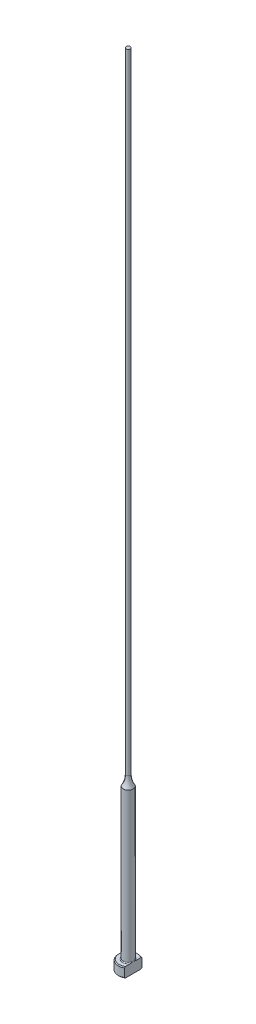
ISO-10303-21;
HEADER;
FILE_DESCRIPTION(('STEP AP214'),'2;1');
FILE_NAME('part.step','',(''),(''),'','','');
FILE_SCHEMA(('AUTOMOTIVE_DESIGN { 1 0 10303 214 1 1 1 1 }'));
ENDSEC;
DATA;
#1=APPLICATION_CONTEXT('core data for automotive mechanical design processes');
#2=APPLICATION_PROTOCOL_DEFINITION('international standard','automotive_design',2000,#1);
#3=PRODUCT_CONTEXT('',#1,'mechanical');
#4=PRODUCT('Part','Part','',(#3));
#5=PRODUCT_RELATED_PRODUCT_CATEGORY('part','',(#4));
#6=PRODUCT_DEFINITION_FORMATION('','',#4);
#7=PRODUCT_DEFINITION_CONTEXT('part definition',#1,'design');
#8=PRODUCT_DEFINITION('design','',#6,#7);
#9=PRODUCT_DEFINITION_SHAPE('','',#8);
#10=(LENGTH_UNIT() NAMED_UNIT(*) SI_UNIT(.MILLI.,.METRE.));
#11=(NAMED_UNIT(*) PLANE_ANGLE_UNIT() SI_UNIT($,.RADIAN.));
#12=(NAMED_UNIT(*) SI_UNIT($,.STERADIAN.) SOLID_ANGLE_UNIT());
#13=UNCERTAINTY_MEASURE_WITH_UNIT(LENGTH_MEASURE(1.E-05),#10,'distance_accuracy_value','');
#14=(GEOMETRIC_REPRESENTATION_CONTEXT(3) GLOBAL_UNCERTAINTY_ASSIGNED_CONTEXT((#13)) GLOBAL_UNIT_ASSIGNED_CONTEXT((#10,
#11,#12)) REPRESENTATION_CONTEXT('',''));
#15=CARTESIAN_POINT('',(0.,0.,0.));
#16=DIRECTION('',(0.,0.,1.));
#17=DIRECTION('',(1.,0.,0.));
#18=AXIS2_PLACEMENT_3D('',#15,#16,#17);
#19=CARTESIAN_POINT('',(-3.17499999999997,3.175,0.));
#20=DIRECTION('',(0.,1.,0.));
#21=DIRECTION('',(0.,0.,1.));
#22=AXIS2_PLACEMENT_3D('',#19,#20,#21);
#23=PLANE('',#22);
#24=CARTESIAN_POINT('',(0.,3.175,0.));
#25=DIRECTION('',(0.,1.,0.));
#26=DIRECTION('',(0.,0.,1.));
#27=AXIS2_PLACEMENT_3D('',#24,#25,#26);
#28=CIRCLE('',#27,2.92099999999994);
#29=CARTESIAN_POINT('',(1.58749999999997,3.175,-2.45195529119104));
#30=VERTEX_POINT('',#29);
#31=CARTESIAN_POINT('',(1.58749999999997,3.175,2.45195529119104));
#32=VERTEX_POINT('',#31);
#33=EDGE_CURVE('E105',#30,#32,#28,.T.);
#34=ORIENTED_EDGE('',*,*,#33,.T.);
#35=DIRECTION('',(0.,0.,1.));
#36=VECTOR('',#35,1.);
#37=CARTESIAN_POINT('',(1.58749999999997,3.17499999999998,2.74963065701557));
#38=LINE('',#37,#36);
#39=CARTESIAN_POINT('',(1.58749999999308,3.175,0.933255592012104));
#40=VERTEX_POINT('',#39);
#41=EDGE_CURVE('E126',#40,#32,#38,.T.);
#42=ORIENTED_EDGE('',*,*,#41,.F.);
#43=CARTESIAN_POINT('',(0.,3.175,0.));
#44=DIRECTION('',(0.,1.,0.));
#45=DIRECTION('',(0.,0.,1.));
#46=AXIS2_PLACEMENT_3D('',#43,#44,#45);
#47=CIRCLE('',#46,1.84149999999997);
#48=CARTESIAN_POINT('',(1.58749999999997,3.17500000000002,-0.933255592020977));
#49=VERTEX_POINT('',#48);
#50=EDGE_CURVE('E11',#40,#49,#47,.F.);
#51=ORIENTED_EDGE('',*,*,#50,.T.);
#52=EDGE_CURVE('E52',#30,#49,#38,.T.);
#53=ORIENTED_EDGE('',*,*,#52,.F.);
#54=EDGE_LOOP('',(#34,#42,#51,#53));
#55=FACE_BOUND('',#54,.T.);
#56=ADVANCED_FACE('F32',(#55),#23,.T.);
#57=CARTESIAN_POINT('',(0.,259.958771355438,0.));
#58=DIRECTION('',(0.,1.,0.));
#59=DIRECTION('',(0.,0.,1.));
#60=AXIS2_PLACEMENT_3D('',#57,#58,#59);
#61=CYLINDRICAL_SURFACE('',#60,3.17499999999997);
#62=CARTESIAN_POINT('',(0.,2.92100000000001,0.));
#63=DIRECTION('',(0.,1.,0.));
#64=DIRECTION('',(0.,0.,1.));
#65=AXIS2_PLACEMENT_3D('',#62,#63,#64);
#66=CIRCLE('',#65,3.17499999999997);
#67=CARTESIAN_POINT('',(1.58749999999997,2.92100000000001,2.74963065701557));
#68=VERTEX_POINT('',#67);
#69=CARTESIAN_POINT('',(1.58749999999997,2.92100000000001,-2.74963065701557));
#70=VERTEX_POINT('',#69);
#71=EDGE_CURVE('E98',#68,#70,#66,.F.);
#72=ORIENTED_EDGE('',*,*,#71,.T.);
#73=DIRECTION('',(0.,-1.,0.));
#74=VECTOR('',#73,1.);
#75=CARTESIAN_POINT('',(1.58749999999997,254.001,-2.74963065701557));
#76=LINE('',#75,#74);
#77=CARTESIAN_POINT('',(1.58749999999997,0.253999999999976,-2.74963065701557));
#78=VERTEX_POINT('',#77);
#79=EDGE_CURVE('E141',#70,#78,#76,.T.);
#80=ORIENTED_EDGE('',*,*,#79,.T.);
#81=CARTESIAN_POINT('',(0.,0.253999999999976,0.));
#82=DIRECTION('',(0.,-1.,0.));
#83=DIRECTION('',(0.,0.,-1.));
#84=AXIS2_PLACEMENT_3D('',#81,#82,#83);
#85=CIRCLE('',#84,3.17499999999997);
#86=CARTESIAN_POINT('',(1.58749999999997,0.253999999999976,2.74963065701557));
#87=VERTEX_POINT('',#86);
#88=EDGE_CURVE('E95',#78,#87,#85,.F.);
#89=ORIENTED_EDGE('',*,*,#88,.T.);
#90=DIRECTION('',(0.,-1.,0.));
#91=VECTOR('',#90,1.);
#92=CARTESIAN_POINT('',(1.58749999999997,254.001,2.74963065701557));
#93=LINE('',#92,#91);
#94=EDGE_CURVE('E88',#68,#87,#93,.T.);
#95=ORIENTED_EDGE('',*,*,#94,.F.);
#96=EDGE_LOOP('',(#72,#80,#89,#95));
#97=FACE_BOUND('',#96,.T.);
#98=ADVANCED_FACE('F191',(#97),#61,.T.);
#99=CARTESIAN_POINT('',(0.,0.,0.));
#100=DIRECTION('',(0.,-1.,0.));
#101=DIRECTION('',(0.,0.,-1.));
#102=AXIS2_PLACEMENT_3D('',#99,#100,#101);
#103=PLANE('',#102);
#104=CARTESIAN_POINT('',(0.,0.,0.));
#105=DIRECTION('',(0.,-1.,0.));
#106=DIRECTION('',(0.,0.,-1.));
#107=AXIS2_PLACEMENT_3D('',#104,#105,#106);
#108=CIRCLE('',#107,2.92100000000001);
#109=CARTESIAN_POINT('',(1.58749999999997,0.,2.45195529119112));
#110=VERTEX_POINT('',#109);
#111=CARTESIAN_POINT('',(1.58749999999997,0.,-2.45195529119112));
#112=VERTEX_POINT('',#111);
#113=EDGE_CURVE('E93',#110,#112,#108,.T.);
#114=ORIENTED_EDGE('',*,*,#113,.T.);
#115=DIRECTION('',(0.,0.,1.));
#116=VECTOR('',#115,1.);
#117=CARTESIAN_POINT('',(1.58749999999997,0.,2.74963065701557));
#118=LINE('',#117,#116);
#119=EDGE_CURVE('E78',#112,#110,#118,.T.);
#120=ORIENTED_EDGE('',*,*,#119,.T.);
#121=EDGE_LOOP('',(#114,#120));
#122=FACE_BOUND('',#121,.T.);
#123=ADVANCED_FACE('F97',(#122),#103,.T.);
#124=CARTESIAN_POINT('',(0.,3.17499999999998,0.));
#125=DIRECTION('',(0.,-1.,0.));
#126=DIRECTION('',(0.,0.,-1.));
#127=AXIS2_PLACEMENT_3D('',#124,#125,#126);
#128=CONICAL_SURFACE('',#127,2.92099999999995,0.785398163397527);
#129=ORIENTED_EDGE('',*,*,#71,.F.);
#130=CARTESIAN_POINT('',(1.58749999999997,-0.16162066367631,-6.0529050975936));
#131=CARTESIAN_POINT('',(1.58749999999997,-0.0288893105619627,-5.91567682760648));
#132=CARTESIAN_POINT('',(1.58749999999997,0.103699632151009,-5.7783103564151));
#133=CARTESIAN_POINT('',(1.58749999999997,0.368508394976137,-5.50321874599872));
#134=CARTESIAN_POINT('',(1.58749999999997,0.500728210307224,-5.36549360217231));
#135=CARTESIAN_POINT('',(1.58749999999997,0.764778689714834,-5.08953516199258));
#136=CARTESIAN_POINT('',(1.58749999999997,0.896609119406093,-4.9513016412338));
#137=CARTESIAN_POINT('',(1.58749999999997,1.15968706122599,-4.67428233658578));
#138=CARTESIAN_POINT('',(1.58749999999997,1.29093457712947,-4.53549655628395));
#139=CARTESIAN_POINT('',(1.58749999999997,1.55007705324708,-4.25997724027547));
#140=CARTESIAN_POINT('',(1.58749999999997,1.67798684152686,-4.12325766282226));
#141=CARTESIAN_POINT('',(1.58749999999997,1.9328486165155,-3.84892898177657));
#142=CARTESIAN_POINT('',(1.58749999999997,2.05980060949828,-3.71131988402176));
#143=CARTESIAN_POINT('',(1.58749999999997,2.31237508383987,-3.43493978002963));
#144=CARTESIAN_POINT('',(1.58749999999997,2.43799784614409,-3.29616903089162));
#145=CARTESIAN_POINT('',(1.58749999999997,2.68741369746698,-3.01699558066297));
#146=CARTESIAN_POINT('',(1.58749999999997,2.81120686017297,-2.8765929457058));
#147=CARTESIAN_POINT('',(1.58749999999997,3.00875865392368,-2.64816703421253));
#148=CARTESIAN_POINT('',(1.58749999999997,3.08336151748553,-2.56087478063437));
#149=CARTESIAN_POINT('',(1.58749999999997,3.2312387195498,-2.38515423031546));
#150=CARTESIAN_POINT('',(1.58749999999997,3.30451292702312,-2.29672582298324));
#151=CARTESIAN_POINT('',(1.58749999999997,3.45004422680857,-2.1174740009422));
#152=CARTESIAN_POINT('',(1.58749999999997,3.5222823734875,-2.02663514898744));
#153=CARTESIAN_POINT('',(1.58749999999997,3.66423097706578,-1.8430252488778));
#154=CARTESIAN_POINT('',(1.58749999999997,3.73394203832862,-1.75025467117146));
#155=CARTESIAN_POINT('',(1.58749999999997,3.87080633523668,-1.5606747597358));
#156=CARTESIAN_POINT('',(1.58749999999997,3.93790459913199,-1.46382547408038));
#157=CARTESIAN_POINT('',(1.58749999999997,4.06669147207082,-1.26632594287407));
#158=CARTESIAN_POINT('',(1.58749999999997,4.1283726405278,-1.16567073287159));
#159=CARTESIAN_POINT('',(1.58749999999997,4.21402252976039,-1.01165766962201));
#160=CARTESIAN_POINT('',(1.58749999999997,4.24127929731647,-0.960142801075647));
#161=CARTESIAN_POINT('',(1.58749999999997,4.2930979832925,-0.855780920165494));
#162=CARTESIAN_POINT('',(1.58749999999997,4.31765941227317,-0.802933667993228));
#163=CARTESIAN_POINT('',(1.58749999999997,4.38614656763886,-0.642461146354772));
#164=CARTESIAN_POINT('',(1.58749999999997,4.42510149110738,-0.532518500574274));
#165=CARTESIAN_POINT('',(1.58749999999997,4.46726244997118,-0.367680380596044));
#166=CARTESIAN_POINT('',(1.58749999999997,4.47844427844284,-0.314802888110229));
#167=CARTESIAN_POINT('',(1.58749999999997,4.49576654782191,-0.208209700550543));
#168=CARTESIAN_POINT('',(1.58749999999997,4.50190743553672,-0.154494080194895));
#169=CARTESIAN_POINT('',(1.58749999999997,4.50871296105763,-0.0468792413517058));
#170=CARTESIAN_POINT('',(1.58749999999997,4.5093945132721,0.00701889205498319));
#171=CARTESIAN_POINT('',(1.58749999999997,4.50527679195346,0.114606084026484));
#172=CARTESIAN_POINT('',(1.58749999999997,4.50047706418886,0.168295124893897));
#173=CARTESIAN_POINT('',(1.58749999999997,4.48579689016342,0.27448544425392));
#174=CARTESIAN_POINT('',(1.58749999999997,4.47596081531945,0.32699298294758));
#175=CARTESIAN_POINT('',(1.58749999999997,4.45181809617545,0.430974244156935));
#176=CARTESIAN_POINT('',(1.58749999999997,4.4375096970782,0.482447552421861));
#177=CARTESIAN_POINT('',(1.58749999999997,4.40502489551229,0.584460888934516));
#178=CARTESIAN_POINT('',(1.58749999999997,4.386827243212,0.634994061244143));
#179=CARTESIAN_POINT('',(1.58749999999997,4.34729308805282,0.734789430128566));
#180=CARTESIAN_POINT('',(1.58749999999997,4.3259572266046,0.784051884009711));
#181=CARTESIAN_POINT('',(1.58749999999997,4.25791922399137,0.930549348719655));
#182=CARTESIAN_POINT('',(1.58749999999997,4.20736047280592,1.0259880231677));
#183=CARTESIAN_POINT('',(1.58749999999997,4.0995545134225,1.21304313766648));
#184=CARTESIAN_POINT('',(1.58749999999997,4.04229912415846,1.30465471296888));
#185=CARTESIAN_POINT('',(1.58749999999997,3.92308746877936,1.48526211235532));
#186=CARTESIAN_POINT('',(1.58749999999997,3.86111349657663,1.57424615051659));
#187=CARTESIAN_POINT('',(1.58749999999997,3.73408621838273,1.74990003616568));
#188=CARTESIAN_POINT('',(1.58749999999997,3.66903444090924,1.83657099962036));
#189=CARTESIAN_POINT('',(1.58749999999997,3.53583371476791,2.00931764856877));
#190=CARTESIAN_POINT('',(1.58749999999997,3.46765527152,2.09537048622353));
#191=CARTESIAN_POINT('',(1.58749999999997,3.32960643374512,2.26611736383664));
#192=CARTESIAN_POINT('',(1.58749999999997,3.25973586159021,2.35081125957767));
#193=CARTESIAN_POINT('',(1.58749999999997,3.04858139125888,2.60290121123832));
#194=CARTESIAN_POINT('',(1.58749999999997,2.90542388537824,2.76872537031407));
#195=CARTESIAN_POINT('',(1.58749999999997,2.64069522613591,3.06970913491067));
#196=CARTESIAN_POINT('',(1.58749999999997,2.51959458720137,3.20528660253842));
#197=CARTESIAN_POINT('',(1.58749999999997,2.27590400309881,3.47510321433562));
#198=CARTESIAN_POINT('',(1.58749999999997,2.15331401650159,3.60934232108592));
#199=CARTESIAN_POINT('',(1.58749999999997,1.90694239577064,3.87695374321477));
#200=CARTESIAN_POINT('',(1.58749999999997,1.78315974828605,4.0103251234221));
#201=CARTESIAN_POINT('',(1.58749999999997,1.53478104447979,4.27630880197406));
#202=CARTESIAN_POINT('',(1.58749999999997,1.41018498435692,4.40892109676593));
#203=CARTESIAN_POINT('',(1.58749999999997,1.0457468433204,4.79499418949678));
#204=CARTESIAN_POINT('',(1.58749999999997,0.80507680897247,5.04767313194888));
#205=CARTESIAN_POINT('',(1.58749999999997,0.443121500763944,5.42550911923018));
#206=CARTESIAN_POINT('',(1.58749999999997,0.322378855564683,5.55118772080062));
#207=CARTESIAN_POINT('',(1.58749999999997,0.0805914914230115,5.80225207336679));
#208=CARTESIAN_POINT('',(1.58749999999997,-0.040453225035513,5.92763782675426));
#209=CARTESIAN_POINT('',(1.58749999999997,-0.161620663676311,6.0529050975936));
#210=B_SPLINE_CURVE_WITH_KNOTS('',3,(#130,#131,#132,#133,#134,#135,#136,#137,#138,#139,#140,
#141,#142,#143,#144,#145,#146,#147,#148,#149,#150,#151,#152,#153,#154,#155,#156,#157,#158,#159,
#160,#161,#162,#163,#164,#165,#166,#167,#168,#169,#170,#171,#172,#173,#174,#175,#176,#177,#178,
#179,#180,#181,#182,#183,#184,#185,#186,#187,#188,#189,#190,#191,#192,#193,#194,#195,#196,#197,
#198,#199,#200,#201,#202,#203,#204,#205,#206,#207,#208,#209),.UNSPECIFIED.,.F.,.F.,(4,2,2,2,2,2,
2,2,2,2,2,2,2,2,2,2,2,2,2,2,2,2,2,2,2,2,2,2,2,2,2,2,2,2,2,2,2,2,2,4),(0.,0.572750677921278,
1.14550874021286,1.71856057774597,2.29160869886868,2.85328006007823,3.4149477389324,
3.97649423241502,4.53801804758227,4.88249307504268,5.22700189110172,5.5751532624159,
5.92322081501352,6.27657800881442,6.63041319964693,6.80518126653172,6.9799810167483,
7.3282426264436,7.49018491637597,7.65211285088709,7.81353889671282,7.97497832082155,
8.13501929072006,8.29512313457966,8.45612518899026,8.61709438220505,8.94062993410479,
9.2645649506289,9.58978187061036,9.91483894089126,10.2441741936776,10.5735441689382,
11.2306812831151,11.7760337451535,12.3214014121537,12.8672825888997,13.4131663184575,
14.4600164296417,14.9828595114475,15.5056983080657),.UNSPECIFIED.);
#211=EDGE_CURVE('E118',#32,#68,#210,.T.);
#212=ORIENTED_EDGE('',*,*,#211,.F.);
#213=ORIENTED_EDGE('',*,*,#33,.F.);
#214=EDGE_CURVE('E117',#70,#30,#210,.T.);
#215=ORIENTED_EDGE('',*,*,#214,.F.);
#216=EDGE_LOOP('',(#129,#212,#213,#215));
#217=FACE_BOUND('',#216,.T.);
#218=ADVANCED_FACE('F162',(#217),#128,.T.);
#219=CARTESIAN_POINT('',(0.,0.253999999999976,0.));
#220=DIRECTION('',(0.,1.,0.));
#221=DIRECTION('',(0.,0.,1.));
#222=AXIS2_PLACEMENT_3D('',#219,#220,#221);
#223=CONICAL_SURFACE('',#222,3.17499999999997,0.785398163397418);
#224=ORIENTED_EDGE('',*,*,#88,.F.);
#225=CARTESIAN_POINT('',(1.58749999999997,3.33662066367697,6.0529050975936));
#226=CARTESIAN_POINT('',(1.58749999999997,3.20388931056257,5.91567682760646));
#227=CARTESIAN_POINT('',(1.58749999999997,3.07130036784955,5.77831035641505));
#228=CARTESIAN_POINT('',(1.58749999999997,2.80649160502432,5.50321874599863));
#229=CARTESIAN_POINT('',(1.58749999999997,2.67427178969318,5.3654936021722));
#230=CARTESIAN_POINT('',(1.58749999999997,2.41022131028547,5.08953516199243));
#231=CARTESIAN_POINT('',(1.58749999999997,2.27839088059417,4.95130164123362));
#232=CARTESIAN_POINT('',(1.58749999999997,2.01531293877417,4.67428233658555));
#233=CARTESIAN_POINT('',(1.58749999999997,1.88406542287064,4.5354965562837));
#234=CARTESIAN_POINT('',(1.58749999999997,1.62492294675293,4.25997724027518));
#235=CARTESIAN_POINT('',(1.58749999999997,1.49701315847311,4.12325766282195));
#236=CARTESIAN_POINT('',(1.58749999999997,1.24215138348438,3.84892898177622));
#237=CARTESIAN_POINT('',(1.58749999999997,1.11519939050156,3.71131988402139));
#238=CARTESIAN_POINT('',(1.58749999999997,0.862624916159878,3.43493978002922));
#239=CARTESIAN_POINT('',(1.58749999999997,0.737002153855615,3.29616903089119));
#240=CARTESIAN_POINT('',(1.58749999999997,0.487586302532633,3.01699558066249));
#241=CARTESIAN_POINT('',(1.58749999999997,0.363793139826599,2.8765929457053));
#242=CARTESIAN_POINT('',(1.58749999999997,0.166241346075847,2.64816703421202));
#243=CARTESIAN_POINT('',(1.58749999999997,0.0916384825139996,2.56087478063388));
#244=CARTESIAN_POINT('',(1.58749999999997,-0.0562387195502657,2.385154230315));
#245=CARTESIAN_POINT('',(1.58749999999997,-0.129512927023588,2.29672582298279));
#246=CARTESIAN_POINT('',(1.58749999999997,-0.27504422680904,2.11747400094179));
#247=CARTESIAN_POINT('',(1.58749999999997,-0.347282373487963,2.02663514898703));
#248=CARTESIAN_POINT('',(1.58749999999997,-0.489230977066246,1.84302524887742));
#249=CARTESIAN_POINT('',(1.58749999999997,-0.558942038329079,1.7502546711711));
#250=CARTESIAN_POINT('',(1.58749999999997,-0.695806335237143,1.56067475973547));
#251=CARTESIAN_POINT('',(1.58749999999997,-0.762904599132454,1.46382547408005));
#252=CARTESIAN_POINT('',(1.58749999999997,-0.891691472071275,1.26632594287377));
#253=CARTESIAN_POINT('',(1.58749999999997,-0.953372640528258,1.16567073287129));
#254=CARTESIAN_POINT('',(1.58749999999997,-1.03902252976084,1.01165766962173));
#255=CARTESIAN_POINT('',(1.58749999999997,-1.06627929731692,0.960142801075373));
#256=CARTESIAN_POINT('',(1.58749999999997,-1.11809798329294,0.85578092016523));
#257=CARTESIAN_POINT('',(1.58749999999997,-1.14265941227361,0.802933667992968));
#258=CARTESIAN_POINT('',(1.58749999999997,-1.21114656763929,0.642461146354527));
#259=CARTESIAN_POINT('',(1.58749999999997,-1.2501014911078,0.532518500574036));
#260=CARTESIAN_POINT('',(1.58749999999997,-1.29226244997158,0.367680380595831));
#261=CARTESIAN_POINT('',(1.58749999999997,-1.30344427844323,0.314802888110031));
#262=CARTESIAN_POINT('',(1.58749999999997,-1.32076654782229,0.208209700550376));
#263=CARTESIAN_POINT('',(1.58749999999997,-1.3269074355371,0.154494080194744));
#264=CARTESIAN_POINT('',(1.58749999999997,-1.333712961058,0.0468792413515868));
#265=CARTESIAN_POINT('',(1.58749999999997,-1.33439451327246,-0.00701889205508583));
#266=CARTESIAN_POINT('',(1.58749999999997,-1.33027679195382,-0.114606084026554));
#267=CARTESIAN_POINT('',(1.58749999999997,-1.32547706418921,-0.168295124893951));
#268=CARTESIAN_POINT('',(1.58749999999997,-1.31079689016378,-0.274485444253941));
#269=CARTESIAN_POINT('',(1.58749999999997,-1.3009608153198,-0.326992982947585));
#270=CARTESIAN_POINT('',(1.58749999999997,-1.27681809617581,-0.430974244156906));
#271=CARTESIAN_POINT('',(1.58749999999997,-1.26250969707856,-0.482447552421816));
#272=CARTESIAN_POINT('',(1.58749999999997,-1.23002489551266,-0.584460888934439));
#273=CARTESIAN_POINT('',(1.58749999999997,-1.21182724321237,-0.634994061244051));
#274=CARTESIAN_POINT('',(1.58749999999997,-1.1722930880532,-0.734789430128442));
#275=CARTESIAN_POINT('',(1.58749999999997,-1.15095722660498,-0.784051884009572));
#276=CARTESIAN_POINT('',(1.58749999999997,-1.08291922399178,-0.93054934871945));
#277=CARTESIAN_POINT('',(1.58749999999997,-1.03236047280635,-1.02598802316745));
#278=CARTESIAN_POINT('',(1.58749999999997,-0.924554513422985,-1.21304313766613));
#279=CARTESIAN_POINT('',(1.58749999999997,-0.86729912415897,-1.30465471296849));
#280=CARTESIAN_POINT('',(1.58749999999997,-0.748087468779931,-1.48526211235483));
#281=CARTESIAN_POINT('',(1.58749999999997,-0.686113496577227,-1.57424615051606));
#282=CARTESIAN_POINT('',(1.58749999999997,-0.55908621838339,-1.74990003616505));
#283=CARTESIAN_POINT('',(1.58749999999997,-0.494034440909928,-1.83657099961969));
#284=CARTESIAN_POINT('',(1.58749999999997,-0.360833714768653,-2.00931764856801));
#285=CARTESIAN_POINT('',(1.58749999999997,-0.292655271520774,-2.09537048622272));
#286=CARTESIAN_POINT('',(1.58749999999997,-0.154606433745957,-2.26611736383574));
#287=CARTESIAN_POINT('',(1.58749999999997,-0.0847358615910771,-2.35081125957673));
#288=CARTESIAN_POINT('',(1.58749999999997,0.126418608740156,-2.60290121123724));
#289=CARTESIAN_POINT('',(1.58749999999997,0.269576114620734,-2.76872537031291));
#290=CARTESIAN_POINT('',(1.58749999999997,0.534304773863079,-3.06970913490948));
#291=CARTESIAN_POINT('',(1.58749999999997,0.655405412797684,-3.20528660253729));
#292=CARTESIAN_POINT('',(1.58749999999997,0.899095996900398,-3.47510321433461));
#293=CARTESIAN_POINT('',(1.58749999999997,1.02168598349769,-3.60934232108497));
#294=CARTESIAN_POINT('',(1.58749999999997,1.26805760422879,-3.87695374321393));
#295=CARTESIAN_POINT('',(1.58749999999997,1.39184025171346,-4.01032512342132));
#296=CARTESIAN_POINT('',(1.58749999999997,1.64021895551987,-4.2763088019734));
#297=CARTESIAN_POINT('',(1.58749999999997,1.76481501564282,-4.40892109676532));
#298=CARTESIAN_POINT('',(1.58749999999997,2.12925315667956,-4.79499418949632));
#299=CARTESIAN_POINT('',(1.58749999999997,2.36992319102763,-5.04767313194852));
#300=CARTESIAN_POINT('',(1.58749999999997,2.73187849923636,-5.42550911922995));
#301=CARTESIAN_POINT('',(1.58749999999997,2.85262114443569,-5.55118772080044));
#302=CARTESIAN_POINT('',(1.58749999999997,3.09440850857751,-5.8022520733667));
#303=CARTESIAN_POINT('',(1.58749999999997,3.2154532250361,-5.92763782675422));
#304=CARTESIAN_POINT('',(1.58749999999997,3.33662066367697,-6.0529050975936));
#305=B_SPLINE_CURVE_WITH_KNOTS('',3,(#225,#226,#227,#228,#229,#230,#231,#232,#233,#234,#235,
#236,#237,#238,#239,#240,#241,#242,#243,#244,#245,#246,#247,#248,#249,#250,#251,#252,#253,#254,
#255,#256,#257,#258,#259,#260,#261,#262,#263,#264,#265,#266,#267,#268,#269,#270,#271,#272,#273,
#274,#275,#276,#277,#278,#279,#280,#281,#282,#283,#284,#285,#286,#287,#288,#289,#290,#291,#292,
#293,#294,#295,#296,#297,#298,#299,#300,#301,#302,#303,#304),.UNSPECIFIED.,.F.,.F.,(4,2,2,2,2,2,
2,2,2,2,2,2,2,2,2,2,2,2,2,2,2,2,2,2,2,2,2,2,2,2,2,2,2,2,2,2,2,2,2,4),(0.,0.57275067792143,
1.14550874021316,1.71856057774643,2.29160869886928,2.85328006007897,3.41494773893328,
3.97649423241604,4.53801804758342,4.88249307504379,5.2270018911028,5.57515326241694,
5.92322081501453,6.27657800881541,6.63041319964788,6.80518126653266,6.97998101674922,
7.32824262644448,7.49018491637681,7.65211285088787,7.81353889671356,7.97497832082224,
8.1350192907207,8.29512313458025,8.45612518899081,8.61709438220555,8.94062993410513,
9.26456495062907,9.58978187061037,9.91483894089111,10.2441741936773,10.5735441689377,
11.2306812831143,11.776033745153,12.3214014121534,12.8672825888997,13.4131663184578,
14.4600164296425,14.9828595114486,15.505698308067),.UNSPECIFIED.);
#306=EDGE_CURVE('E81',#112,#78,#305,.T.);
#307=ORIENTED_EDGE('',*,*,#306,.F.);
#308=ORIENTED_EDGE('',*,*,#113,.F.);
#309=EDGE_CURVE('E84',#87,#110,#305,.T.);
#310=ORIENTED_EDGE('',*,*,#309,.F.);
#311=EDGE_LOOP('',(#224,#307,#308,#310));
#312=FACE_BOUND('',#311,.T.);
#313=ADVANCED_FACE('F92',(#312),#223,.T.);
#314=CARTESIAN_POINT('',(0.,3.42900000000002,0.));
#315=DIRECTION('',(0.,1.,0.));
#316=DIRECTION('',(0.,0.,1.));
#317=AXIS2_PLACEMENT_3D('',#314,#315,#316);
#318=TOROIDAL_SURFACE('',#317,1.84149999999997,0.254);
#319=CARTESIAN_POINT('',(1.58749999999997,3.42900000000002,0.));
#320=CARTESIAN_POINT('',(1.58749999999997,3.42899942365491,-1.9220514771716E-10));
#321=CARTESIAN_POINT('',(1.58749999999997,3.42899884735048,-1.2261161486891E-07));
#322=CARTESIAN_POINT('',(1.58749999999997,3.42899773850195,-5.09676365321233E-07));
#323=CARTESIAN_POINT('',(1.58749999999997,3.42899720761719,-7.78176328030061E-07));
#324=CARTESIAN_POINT('',(1.58749999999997,3.42899614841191,-1.42307272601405E-06));
#325=CARTESIAN_POINT('',(1.58749999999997,3.42899562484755,-1.80713867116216E-06));
#326=CARTESIAN_POINT('',(1.58749999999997,3.42899463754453,-2.63494846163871E-06));
#327=CARTESIAN_POINT('',(1.58749999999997,3.42899417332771,-3.07814756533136E-06));
#328=CARTESIAN_POINT('',(1.58749999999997,3.42899261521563,-4.66897357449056E-06));
#329=CARTESIAN_POINT('',(1.58749999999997,3.42899159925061,-5.89404908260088E-06));
#330=CARTESIAN_POINT('',(1.58749999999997,3.42898979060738,-8.42427511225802E-06));
#331=CARTESIAN_POINT('',(1.58749999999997,3.42898899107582,-9.7248057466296E-06));
#332=CARTESIAN_POINT('',(1.58749999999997,3.42898598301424,-1.48060601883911E-05));
#333=CARTESIAN_POINT('',(1.58749999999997,3.42898393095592,-1.86838281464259E-05));
#334=CARTESIAN_POINT('',(1.58749999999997,3.42898057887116,-2.63261117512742E-05));
#335=CARTESIAN_POINT('',(1.58749999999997,3.42897922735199,-3.00687417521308E-05));
#336=CARTESIAN_POINT('',(1.58749999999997,3.42897347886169,-4.60276298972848E-05));
#337=CARTESIAN_POINT('',(1.58749999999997,3.42896911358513,-5.8247019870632E-05));
#338=CARTESIAN_POINT('',(1.58749999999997,3.42896211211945,-8.11070097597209E-05));
#339=CARTESIAN_POINT('',(1.58749999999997,3.42895931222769,-9.16953114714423E-05));
#340=CARTESIAN_POINT('',(1.58749999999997,3.42893712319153,-0.000168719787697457));
#341=CARTESIAN_POINT('',(1.58749999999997,3.42890881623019,-0.000232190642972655));
#342=CARTESIAN_POINT('',(1.58749999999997,3.42880276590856,-0.000479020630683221));
#343=CARTESIAN_POINT('',(1.58749999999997,3.42873165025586,-0.00066443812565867));
#344=CARTESIAN_POINT('',(1.58749999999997,3.42845137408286,-0.0013844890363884));
#345=CARTESIAN_POINT('',(1.58749999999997,3.42823526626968,-0.00191701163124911));
#346=CARTESIAN_POINT('',(1.58749999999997,3.42735449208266,-0.00409774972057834));
#347=CARTESIAN_POINT('',(1.58749999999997,3.42669768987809,-0.00574830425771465));
#348=CARTESIAN_POINT('',(1.58749999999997,3.4174405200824,-0.0289985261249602));
#349=CARTESIAN_POINT('',(1.58749999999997,3.40878325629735,-0.0505816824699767));
#350=CARTESIAN_POINT('',(1.58749999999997,3.39189297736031,-0.0929947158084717));
#351=CARTESIAN_POINT('',(1.58749999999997,3.38365605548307,-0.11382315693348));
#352=CARTESIAN_POINT('',(1.58749999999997,3.36635393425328,-0.157956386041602));
#353=CARTESIAN_POINT('',(1.58749999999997,3.35730391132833,-0.181267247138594));
#354=CARTESIAN_POINT('',(1.58749999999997,3.33936775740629,-0.228222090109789));
#355=CARTESIAN_POINT('',(1.58749999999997,3.33048420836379,-0.25186705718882));
#356=CARTESIAN_POINT('',(1.58749999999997,3.30894496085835,-0.310512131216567));
#357=CARTESIAN_POINT('',(1.58749999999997,3.29649449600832,-0.345588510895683));
#358=CARTESIAN_POINT('',(1.58749999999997,3.27296975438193,-0.415278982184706));
#359=CARTESIAN_POINT('',(1.58749999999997,3.26186987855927,-0.449884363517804));
#360=CARTESIAN_POINT('',(1.58749999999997,3.2395832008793,-0.524471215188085));
#361=CARTESIAN_POINT('',(1.58749999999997,3.22860862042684,-0.564517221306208));
#362=CARTESIAN_POINT('',(1.58749999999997,3.20902534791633,-0.645529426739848));
#363=CARTESIAN_POINT('',(1.58749999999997,3.20043582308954,-0.686500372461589));
#364=CARTESIAN_POINT('',(1.58749999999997,3.18611712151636,-0.771546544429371));
#365=CARTESIAN_POINT('',(1.58749999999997,3.18059550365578,-0.815658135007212));
#366=CARTESIAN_POINT('',(1.58749999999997,3.17455396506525,-0.904117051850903));
#367=CARTESIAN_POINT('',(1.58749999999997,3.17401361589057,-0.948462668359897));
#368=CARTESIAN_POINT('',(1.58749999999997,3.17898948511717,-1.02531896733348));
#369=CARTESIAN_POINT('',(1.58749999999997,3.1829739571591,-1.05792141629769));
#370=CARTESIAN_POINT('',(1.58749999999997,3.19569167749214,-1.12184393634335));
#371=CARTESIAN_POINT('',(1.58749999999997,3.20436049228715,-1.1531753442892));
#372=CARTESIAN_POINT('',(1.58749999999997,3.22236152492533,-1.19946468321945));
#373=CARTESIAN_POINT('',(1.58749999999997,3.2295150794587,-1.21526783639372));
#374=CARTESIAN_POINT('',(1.58749999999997,3.24587062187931,-1.24583726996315));
#375=CARTESIAN_POINT('',(1.58749999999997,3.25507530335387,-1.26060215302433));
#376=CARTESIAN_POINT('',(1.58749999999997,3.27378481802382,-1.28575815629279));
#377=CARTESIAN_POINT('',(1.58749999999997,3.28289001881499,-1.29644383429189));
#378=CARTESIAN_POINT('',(1.58749999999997,3.30268460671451,-1.31623154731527));
#379=CARTESIAN_POINT('',(1.58749999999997,3.31337067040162,-1.32533681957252));
#380=CARTESIAN_POINT('',(1.58749999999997,3.33349977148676,-1.33941140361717));
#381=CARTESIAN_POINT('',(1.58749999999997,3.34261446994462,-1.34484814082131));
#382=CARTESIAN_POINT('',(1.58749999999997,3.36161455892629,-1.35416329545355));
#383=CARTESIAN_POINT('',(1.58749999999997,3.37149946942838,-1.35804267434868));
#384=CARTESIAN_POINT('',(1.58749999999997,3.39188678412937,-1.36398436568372));
#385=CARTESIAN_POINT('',(1.58749999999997,3.40239309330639,-1.36603350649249));
#386=CARTESIAN_POINT('',(1.58749999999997,3.42360372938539,-1.3680840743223));
#387=CARTESIAN_POINT('',(1.58749999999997,3.43430795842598,-1.36808648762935));
#388=CARTESIAN_POINT('',(1.58749999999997,3.45433283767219,-1.36616208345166));
#389=CARTESIAN_POINT('',(1.58749999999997,3.46367506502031,-1.36444960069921));
#390=CARTESIAN_POINT('',(1.58749999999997,3.48195519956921,-1.35953338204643));
#391=CARTESIAN_POINT('',(1.58749999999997,3.49089304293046,-1.3563294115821));
#392=CARTESIAN_POINT('',(1.58749999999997,3.50850302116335,-1.34848006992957));
#393=CARTESIAN_POINT('',(1.58749999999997,3.5171531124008,-1.34378578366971));
#394=CARTESIAN_POINT('',(1.58749999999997,3.53371257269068,-1.33324445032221));
#395=CARTESIAN_POINT('',(1.58749999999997,3.54162163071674,-1.32739692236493));
#396=CARTESIAN_POINT('',(1.58749999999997,3.56107121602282,-1.31107304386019));
#397=CARTESIAN_POINT('',(1.58749999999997,3.57202221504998,-1.29989286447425));
#398=CARTESIAN_POINT('',(1.58749999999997,3.59202509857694,-1.27593566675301));
#399=CARTESIAN_POINT('',(1.58749999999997,3.60107086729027,-1.26315370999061));
#400=CARTESIAN_POINT('',(1.58749999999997,3.62186023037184,-1.22930733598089));
#401=CARTESIAN_POINT('',(1.58749999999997,3.63240584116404,-1.20751096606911));
#402=CARTESIAN_POINT('',(1.58749999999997,3.65004643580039,-1.16266144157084));
#403=CARTESIAN_POINT('',(1.58749999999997,3.65714435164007,-1.13960937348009));
#404=CARTESIAN_POINT('',(1.58749999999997,3.67265428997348,-1.07603916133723));
#405=CARTESIAN_POINT('',(1.58749999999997,3.67834921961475,-1.03486686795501));
#406=CARTESIAN_POINT('',(1.58749999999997,3.68382880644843,-0.951558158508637));
#407=CARTESIAN_POINT('',(1.58749999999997,3.68350976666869,-0.909417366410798));
#408=CARTESIAN_POINT('',(1.58749999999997,3.67745397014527,-0.811383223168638));
#409=CARTESIAN_POINT('',(1.58749999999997,3.66993873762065,-0.755610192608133));
#410=CARTESIAN_POINT('',(1.58749999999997,3.64933373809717,-0.644937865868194));
#411=CARTESIAN_POINT('',(1.58749999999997,3.63621897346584,-0.59004364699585));
#412=CARTESIAN_POINT('',(1.58749999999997,3.60740922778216,-0.485757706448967));
#413=CARTESIAN_POINT('',(1.58749999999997,3.59201096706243,-0.436281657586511));
#414=CARTESIAN_POINT('',(1.58749999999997,3.55922497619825,-0.338551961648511));
#415=CARTESIAN_POINT('',(1.58749999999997,3.5418584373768,-0.290291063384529));
#416=CARTESIAN_POINT('',(1.58749999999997,3.51760237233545,-0.225557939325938));
#417=CARTESIAN_POINT('',(1.58749999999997,3.51126413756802,-0.208874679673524));
#418=CARTESIAN_POINT('',(1.58749999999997,3.49830042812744,-0.17512392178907));
#419=CARTESIAN_POINT('',(1.58749999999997,3.49167176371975,-0.158057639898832));
#420=CARTESIAN_POINT('',(1.58749999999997,3.47585523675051,-0.117638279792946));
#421=CARTESIAN_POINT('',(1.58749999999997,3.46662970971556,-0.0943002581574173));
#422=CARTESIAN_POINT('',(1.58749999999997,3.44889695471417,-0.0497824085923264));
#423=CARTESIAN_POINT('',(1.58749999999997,3.44040039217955,-0.028598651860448));
#424=CARTESIAN_POINT('',(1.58749999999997,3.43130364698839,-0.00575168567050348));
#425=CARTESIAN_POINT('',(1.58749999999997,3.43064818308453,-0.00410451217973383));
#426=CARTESIAN_POINT('',(1.58749999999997,3.42976776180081,-0.00192459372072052));
#427=CARTESIAN_POINT('',(1.58749999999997,3.42955062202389,-0.00138952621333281));
#428=CARTESIAN_POINT('',(1.58749999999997,3.42926908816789,-0.000666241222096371));
#429=CARTESIAN_POINT('',(1.58749999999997,3.42919771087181,-0.000480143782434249));
#430=CARTESIAN_POINT('',(1.58749999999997,3.42909131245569,-0.000232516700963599));
#431=CARTESIAN_POINT('',(1.58749999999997,3.42906294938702,-0.000168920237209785));
#432=CARTESIAN_POINT('',(1.58749999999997,3.42904072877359,-9.17527162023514E-05));
#433=CARTESIAN_POINT('',(1.58749999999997,3.42903792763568,-8.11550293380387E-05));
#434=CARTESIAN_POINT('',(1.58749999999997,3.42903091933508,-5.82743948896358E-05));
#435=CARTESIAN_POINT('',(1.58749999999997,3.42902654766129,-4.60440001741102E-05));
#436=CARTESIAN_POINT('',(1.58749999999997,3.42902079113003,-3.00727682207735E-05));
#437=CARTESIAN_POINT('',(1.58749999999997,3.42901943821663,-2.63286807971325E-05));
#438=CARTESIAN_POINT('',(1.58749999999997,3.42901608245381,-1.86836529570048E-05));
#439=CARTESIAN_POINT('',(1.58749999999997,3.4290140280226,-1.48046517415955E-05));
#440=CARTESIAN_POINT('',(1.58749999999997,3.42901101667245,-9.72223943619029E-06));
#441=CARTESIAN_POINT('',(1.58749999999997,3.42901021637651,-8.42159649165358E-06));
#442=CARTESIAN_POINT('',(1.58749999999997,3.42900840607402,-5.89129729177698E-06));
#443=CARTESIAN_POINT('',(1.58749999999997,3.42900738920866,-4.66626867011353E-06));
#444=CARTESIAN_POINT('',(1.58749999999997,3.42900582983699,-3.07568803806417E-06));
#445=CARTESIAN_POINT('',(1.58749999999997,3.42900536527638,-2.63259565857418E-06));
#446=CARTESIAN_POINT('',(1.58749999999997,3.4290043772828,-1.80506085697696E-06));
#447=CARTESIAN_POINT('',(1.58749999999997,3.42900385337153,-1.42116387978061E-06));
#448=CARTESIAN_POINT('',(1.58749999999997,3.42900279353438,-7.76675643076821E-07));
#449=CARTESIAN_POINT('',(1.58749999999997,3.42900226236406,-5.08406487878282E-07));
#450=CARTESIAN_POINT('',(1.58749999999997,3.42900115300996,-1.21901887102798E-07));
#451=CARTESIAN_POINT('',(1.58749999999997,3.42900057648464,1.92251677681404E-10));
#452=CARTESIAN_POINT('',(1.58749999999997,3.42900000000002,0.));
#453=B_SPLINE_CURVE_WITH_KNOTS('',3,(#319,#320,#321,#322,#323,#324,#325,#326,#327,#328,#329,
#330,#331,#332,#333,#334,#335,#336,#337,#338,#339,#340,#341,#342,#343,#344,#345,#346,#347,#348,
#349,#350,#351,#352,#353,#354,#355,#356,#357,#358,#359,#360,#361,#362,#363,#364,#365,#366,#367,
#368,#369,#370,#371,#372,#373,#374,#375,#376,#377,#378,#379,#380,#381,#382,#383,#384,#385,#386,
#387,#388,#389,#390,#391,#392,#393,#394,#395,#396,#397,#398,#399,#400,#401,#402,#403,#404,#405,
#406,#407,#408,#409,#410,#411,#412,#413,#414,#415,#416,#417,#418,#419,#420,#421,#422,#423,#424,
#425,#426,#427,#428,#429,#430,#431,#432,#433,#434,#435,#436,#437,#438,#439,#440,#441,#442,#443,
#444,#445,#446,#447,#448,#449,#450,#451,#452),.UNSPECIFIED.,.T.,.F.,(4,2,2,2,2,2,2,2,2,2,2,2,2,
2,2,2,2,2,2,2,2,2,2,2,2,2,2,2,2,2,2,2,2,2,2,2,2,2,2,2,2,2,2,2,2,2,2,2,2,2,2,2,2,2,2,2,2,2,2,2,2,
2,2,2,2,2,4),(0.,1.72815458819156E-06,3.50429255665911E-06,5.44431004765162E-06,
7.3675525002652E-06,1.2119089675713E-05,1.66953775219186E-05,2.98160400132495E-05,
4.17409564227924E-05,8.0660475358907E-05,0.000113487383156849,0.000321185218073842,
0.000917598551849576,0.00264089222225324,0.00797105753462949,0.0777276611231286,
0.144923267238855,0.219939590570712,0.295714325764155,0.407362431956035,0.516367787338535,
0.640878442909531,0.766362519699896,0.899536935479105,1.03216495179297,1.13045740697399,
1.22743103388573,1.27935899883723,1.33135556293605,1.37333248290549,1.41522237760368,
1.44693946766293,1.47863694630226,1.51056074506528,1.54246916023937,1.57083210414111,
1.59919951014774,1.62861579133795,1.65804436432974,1.70472658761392,1.75155645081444,
1.82378709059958,1.89595619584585,2.01995471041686,2.1460932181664,2.31447224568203,
2.48361094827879,2.6389891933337,2.79283011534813,2.84637031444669,2.9012946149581,
2.97658236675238,3.04504771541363,3.05036697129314,3.05209849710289,3.05269709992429,
3.05290520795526,3.05293806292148,3.05297701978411,3.05298895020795,3.05300207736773,
3.05300665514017,3.0530114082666,3.05301333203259,3.05301527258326,3.05301704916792,
3.05301877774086),.UNSPECIFIED.);
#454=CARTESIAN_POINT('',(1.58749999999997,3.42900000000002,0.));
#455=VERTEX_POINT('',#454);
#456=EDGE_CURVE('E47',#455,#49,#453,.T.);
#457=ORIENTED_EDGE('',*,*,#456,.T.);
#458=ORIENTED_EDGE('',*,*,#50,.F.);
#459=CARTESIAN_POINT('',(1.58749999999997,3.42900000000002,0.));
#460=CARTESIAN_POINT('',(1.58749999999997,3.42900057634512,1.9220512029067E-10));
#461=CARTESIAN_POINT('',(1.58749999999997,3.42900115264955,1.22611614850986E-07));
#462=CARTESIAN_POINT('',(1.58749999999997,3.42900226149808,5.09676365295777E-07));
#463=CARTESIAN_POINT('',(1.58749999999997,3.42900279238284,7.78176328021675E-07));
#464=CARTESIAN_POINT('',(1.58749999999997,3.42900385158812,1.42307272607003E-06));
#465=CARTESIAN_POINT('',(1.58749999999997,3.42900437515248,1.80713867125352E-06));
#466=CARTESIAN_POINT('',(1.58749999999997,3.4290053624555,2.63494846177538E-06));
#467=CARTESIAN_POINT('',(1.58749999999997,3.42900582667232,3.0781475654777E-06));
#468=CARTESIAN_POINT('',(1.58749999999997,3.4290073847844,4.66897357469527E-06));
#469=CARTESIAN_POINT('',(1.58749999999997,3.42900840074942,5.89404908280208E-06));
#470=CARTESIAN_POINT('',(1.58749999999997,3.42901020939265,8.42427511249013E-06));
#471=CARTESIAN_POINT('',(1.58749999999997,3.42901100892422,9.72480574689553E-06));
#472=CARTESIAN_POINT('',(1.58749999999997,3.42901401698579,1.48060601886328E-05));
#473=CARTESIAN_POINT('',(1.58749999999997,3.42901606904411,1.86838281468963E-05));
#474=CARTESIAN_POINT('',(1.58749999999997,3.42901942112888,2.63261117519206E-05));
#475=CARTESIAN_POINT('',(1.58749999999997,3.42902077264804,3.00687417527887E-05));
#476=CARTESIAN_POINT('',(1.58749999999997,3.42902652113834,4.60276298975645E-05));
#477=CARTESIAN_POINT('',(1.58749999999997,3.4290308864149,5.82470198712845E-05));
#478=CARTESIAN_POINT('',(1.58749999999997,3.42903788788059,8.11070097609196E-05));
#479=CARTESIAN_POINT('',(1.58749999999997,3.42904068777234,9.16953114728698E-05));
#480=CARTESIAN_POINT('',(1.58749999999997,3.4290628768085,0.000168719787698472));
#481=CARTESIAN_POINT('',(1.58749999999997,3.42909118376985,0.000232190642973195));
#482=CARTESIAN_POINT('',(1.58749999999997,3.42919723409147,0.000479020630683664));
#483=CARTESIAN_POINT('',(1.58749999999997,3.42926834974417,0.000664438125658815));
#484=CARTESIAN_POINT('',(1.58749999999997,3.42954862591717,0.00138448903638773));
#485=CARTESIAN_POINT('',(1.58749999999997,3.42976473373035,0.00191701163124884));
#486=CARTESIAN_POINT('',(1.58749999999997,3.43064550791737,0.00409774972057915));
#487=CARTESIAN_POINT('',(1.58749999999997,3.43130231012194,0.00574830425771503));
#488=CARTESIAN_POINT('',(1.58749999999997,3.44055947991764,0.0289985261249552));
#489=CARTESIAN_POINT('',(1.58749999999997,3.44921674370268,0.0505816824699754));
#490=CARTESIAN_POINT('',(1.58749999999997,3.46610702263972,0.0929947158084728));
#491=CARTESIAN_POINT('',(1.58749999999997,3.47434394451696,0.11382315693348));
#492=CARTESIAN_POINT('',(1.58749999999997,3.49164606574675,0.157956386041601));
#493=CARTESIAN_POINT('',(1.58749999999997,3.5006960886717,0.181267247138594));
#494=CARTESIAN_POINT('',(1.58749999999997,3.51863224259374,0.228222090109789));
#495=CARTESIAN_POINT('',(1.58749999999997,3.52751579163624,0.25186705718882));
#496=CARTESIAN_POINT('',(1.58749999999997,3.54905503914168,0.310512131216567));
#497=CARTESIAN_POINT('',(1.58749999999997,3.56150550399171,0.345588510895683));
#498=CARTESIAN_POINT('',(1.58749999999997,3.5850302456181,0.415278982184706));
#499=CARTESIAN_POINT('',(1.58749999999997,3.59613012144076,0.449884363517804));
#500=CARTESIAN_POINT('',(1.58749999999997,3.61841679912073,0.524471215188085));
#501=CARTESIAN_POINT('',(1.58749999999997,3.62939137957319,0.564517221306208));
#502=CARTESIAN_POINT('',(1.58749999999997,3.6489746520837,0.645529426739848));
#503=CARTESIAN_POINT('',(1.58749999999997,3.65756417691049,0.686500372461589));
#504=CARTESIAN_POINT('',(1.58749999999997,3.67188287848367,0.771546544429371));
#505=CARTESIAN_POINT('',(1.58749999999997,3.67740449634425,0.815658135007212));
#506=CARTESIAN_POINT('',(1.58749999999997,3.68344603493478,0.904117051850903));
#507=CARTESIAN_POINT('',(1.58749999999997,3.68398638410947,0.948462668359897));
#508=CARTESIAN_POINT('',(1.58749999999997,3.67901051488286,1.02531896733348));
#509=CARTESIAN_POINT('',(1.58749999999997,3.67502604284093,1.05792141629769));
#510=CARTESIAN_POINT('',(1.58749999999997,3.66230832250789,1.12184393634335));
#511=CARTESIAN_POINT('',(1.58749999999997,3.65363950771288,1.1531753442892));
#512=CARTESIAN_POINT('',(1.58749999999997,3.6356384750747,1.19946468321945));
#513=CARTESIAN_POINT('',(1.58749999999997,3.62848492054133,1.21526783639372));
#514=CARTESIAN_POINT('',(1.58749999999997,3.61212937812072,1.24583726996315));
#515=CARTESIAN_POINT('',(1.58749999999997,3.60292469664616,1.26060215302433));
#516=CARTESIAN_POINT('',(1.58749999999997,3.58421518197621,1.28575815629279));
#517=CARTESIAN_POINT('',(1.58749999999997,3.57510998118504,1.29644383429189));
#518=CARTESIAN_POINT('',(1.58749999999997,3.55531539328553,1.31623154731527));
#519=CARTESIAN_POINT('',(1.58749999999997,3.54462932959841,1.32533681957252));
#520=CARTESIAN_POINT('',(1.58749999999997,3.52450022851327,1.33941140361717));
#521=CARTESIAN_POINT('',(1.58749999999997,3.51538553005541,1.34484814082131));
#522=CARTESIAN_POINT('',(1.58749999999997,3.49638544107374,1.35416329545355));
#523=CARTESIAN_POINT('',(1.58749999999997,3.48650053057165,1.35804267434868));
#524=CARTESIAN_POINT('',(1.58749999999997,3.46611321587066,1.36398436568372));
#525=CARTESIAN_POINT('',(1.58749999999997,3.45560690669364,1.36603350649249));
#526=CARTESIAN_POINT('',(1.58749999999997,3.43439627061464,1.3680840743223));
#527=CARTESIAN_POINT('',(1.58749999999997,3.42369204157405,1.36808648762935));
#528=CARTESIAN_POINT('',(1.58749999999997,3.40366716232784,1.36616208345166));
#529=CARTESIAN_POINT('',(1.58749999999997,3.39432493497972,1.36444960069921));
#530=CARTESIAN_POINT('',(1.58749999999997,3.37604480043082,1.35953338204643));
#531=CARTESIAN_POINT('',(1.58749999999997,3.36710695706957,1.3563294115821));
#532=CARTESIAN_POINT('',(1.58749999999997,3.34949697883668,1.34848006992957));
#533=CARTESIAN_POINT('',(1.58749999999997,3.34084688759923,1.34378578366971));
#534=CARTESIAN_POINT('',(1.58749999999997,3.32428742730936,1.33324445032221));
#535=CARTESIAN_POINT('',(1.58749999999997,3.31637836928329,1.32739692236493));
#536=CARTESIAN_POINT('',(1.58749999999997,3.29692878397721,1.31107304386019));
#537=CARTESIAN_POINT('',(1.58749999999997,3.28597778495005,1.29989286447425));
#538=CARTESIAN_POINT('',(1.58749999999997,3.26597490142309,1.27593566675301));
#539=CARTESIAN_POINT('',(1.58749999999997,3.25692913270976,1.26315370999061));
#540=CARTESIAN_POINT('',(1.58749999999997,3.23613976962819,1.22930733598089));
#541=CARTESIAN_POINT('',(1.58749999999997,3.22559415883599,1.20751096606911));
#542=CARTESIAN_POINT('',(1.58749999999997,3.20795356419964,1.16266144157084));
#543=CARTESIAN_POINT('',(1.58749999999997,3.20085564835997,1.13960937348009));
#544=CARTESIAN_POINT('',(1.58749999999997,3.18534571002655,1.07603916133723));
#545=CARTESIAN_POINT('',(1.58749999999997,3.17965078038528,1.03486686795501));
#546=CARTESIAN_POINT('',(1.58749999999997,3.1741711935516,0.951558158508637));
#547=CARTESIAN_POINT('',(1.58749999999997,3.17449023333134,0.909417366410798));
#548=CARTESIAN_POINT('',(1.58749999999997,3.18054602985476,0.811383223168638));
#549=CARTESIAN_POINT('',(1.58749999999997,3.18806126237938,0.755610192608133));
#550=CARTESIAN_POINT('',(1.58749999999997,3.20866626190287,0.644937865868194));
#551=CARTESIAN_POINT('',(1.58749999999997,3.2217810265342,0.59004364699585));
#552=CARTESIAN_POINT('',(1.58749999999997,3.25059077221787,0.485757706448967));
#553=CARTESIAN_POINT('',(1.58749999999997,3.2659890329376,0.43628165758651));
#554=CARTESIAN_POINT('',(1.58749999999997,3.29877502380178,0.338551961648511));
#555=CARTESIAN_POINT('',(1.58749999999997,3.31614156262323,0.290291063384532));
#556=CARTESIAN_POINT('',(1.58749999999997,3.34039762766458,0.225557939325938));
#557=CARTESIAN_POINT('',(1.58749999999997,3.346735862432,0.208874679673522));
#558=CARTESIAN_POINT('',(1.58749999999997,3.35969957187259,0.175123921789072));
#559=CARTESIAN_POINT('',(1.58749999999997,3.3663282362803,0.15805763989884));
#560=CARTESIAN_POINT('',(1.58749999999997,3.3821447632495,0.117638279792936));
#561=CARTESIAN_POINT('',(1.58749999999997,3.39137029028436,0.0943002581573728));
#562=CARTESIAN_POINT('',(1.58749999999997,3.40910304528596,0.0497824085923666));
#563=CARTESIAN_POINT('',(1.58749999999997,3.41759960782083,0.0285986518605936));
#564=CARTESIAN_POINT('',(1.58749999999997,3.42669635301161,0.00575168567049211));
#565=CARTESIAN_POINT('',(1.58749999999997,3.42735181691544,0.00410451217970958));
#566=CARTESIAN_POINT('',(1.58749999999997,3.42823223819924,0.00192459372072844));
#567=CARTESIAN_POINT('',(1.58749999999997,3.42844937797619,0.00138952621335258));
#568=CARTESIAN_POINT('',(1.58749999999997,3.42873091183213,0.000666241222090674));
#569=CARTESIAN_POINT('',(1.58749999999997,3.42880228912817,0.000480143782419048));
#570=CARTESIAN_POINT('',(1.58749999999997,3.42890868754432,0.000232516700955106));
#571=CARTESIAN_POINT('',(1.58749999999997,3.42893705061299,0.000168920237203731));
#572=CARTESIAN_POINT('',(1.58749999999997,3.42895927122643,9.17527161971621E-05));
#573=CARTESIAN_POINT('',(1.58749999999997,3.42896207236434,8.1155029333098E-05));
#574=CARTESIAN_POINT('',(1.58749999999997,3.42896908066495,5.82743948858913E-05));
#575=CARTESIAN_POINT('',(1.58749999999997,3.42897345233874,4.60440001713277E-05));
#576=CARTESIAN_POINT('',(1.58749999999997,3.42897920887,3.00727682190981E-05));
#577=CARTESIAN_POINT('',(1.58749999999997,3.42898056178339,2.63286807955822E-05));
#578=CARTESIAN_POINT('',(1.58749999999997,3.42898391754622,1.86836529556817E-05));
#579=CARTESIAN_POINT('',(1.58749999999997,3.42898597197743,1.48046517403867E-05));
#580=CARTESIAN_POINT('',(1.58749999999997,3.42898898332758,9.72223943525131E-06));
#581=CARTESIAN_POINT('',(1.58749999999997,3.42898978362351,8.42159649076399E-06));
#582=CARTESIAN_POINT('',(1.58749999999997,3.42899159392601,5.89129729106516E-06));
#583=CARTESIAN_POINT('',(1.58749999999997,3.42899261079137,4.66626866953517E-06));
#584=CARTESIAN_POINT('',(1.58749999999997,3.42899417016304,3.0756880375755E-06));
#585=CARTESIAN_POINT('',(1.58749999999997,3.42899463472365,2.63259565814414E-06));
#586=CARTESIAN_POINT('',(1.58749999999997,3.42899562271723,1.80506085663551E-06));
#587=CARTESIAN_POINT('',(1.58749999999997,3.42899614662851,1.42116387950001E-06));
#588=CARTESIAN_POINT('',(1.58749999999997,3.42899720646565,7.7667564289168E-07));
#589=CARTESIAN_POINT('',(1.58749999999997,3.42899773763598,5.0840648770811E-07));
#590=CARTESIAN_POINT('',(1.58749999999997,3.42899884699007,1.21901887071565E-07));
#591=CARTESIAN_POINT('',(1.58749999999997,3.42899942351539,-1.92251650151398E-10));
#592=CARTESIAN_POINT('',(1.58749999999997,3.42900000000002,0.));
#593=B_SPLINE_CURVE_WITH_KNOTS('',3,(#459,#460,#461,#462,#463,#464,#465,#466,#467,#468,#469,
#470,#471,#472,#473,#474,#475,#476,#477,#478,#479,#480,#481,#482,#483,#484,#485,#486,#487,#488,
#489,#490,#491,#492,#493,#494,#495,#496,#497,#498,#499,#500,#501,#502,#503,#504,#505,#506,#507,
#508,#509,#510,#511,#512,#513,#514,#515,#516,#517,#518,#519,#520,#521,#522,#523,#524,#525,#526,
#527,#528,#529,#530,#531,#532,#533,#534,#535,#536,#537,#538,#539,#540,#541,#542,#543,#544,#545,
#546,#547,#548,#549,#550,#551,#552,#553,#554,#555,#556,#557,#558,#559,#560,#561,#562,#563,#564,
#565,#566,#567,#568,#569,#570,#571,#572,#573,#574,#575,#576,#577,#578,#579,#580,#581,#582,#583,
#584,#585,#586,#587,#588,#589,#590,#591,#592),.UNSPECIFIED.,.T.,.F.,(4,2,2,2,2,2,2,2,2,2,2,2,2,
2,2,2,2,2,2,2,2,2,2,2,2,2,2,2,2,2,2,2,2,2,2,2,2,2,2,2,2,2,2,2,2,2,2,2,2,2,2,2,2,2,2,2,2,2,2,2,2,
2,2,2,2,2,4),(0.,1.72815458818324E-06,3.50429255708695E-06,5.44431004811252E-06,
7.36755250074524E-06,1.21190896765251E-05,1.66953775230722E-05,2.98160400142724E-05,
4.17409564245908E-05,8.06604753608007E-05,0.000113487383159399,0.000321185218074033,
0.000917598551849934,0.00264089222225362,0.00797105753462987,0.077727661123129,
0.144923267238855,0.219939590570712,0.295714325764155,0.407362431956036,0.516367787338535,
0.640878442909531,0.766362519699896,0.899536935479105,1.03216495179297,1.13045740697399,
1.22743103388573,1.27935899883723,1.33135556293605,1.37333248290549,1.41522237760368,
1.44693946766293,1.47863694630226,1.51056074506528,1.54246916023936,1.57083210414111,
1.59919951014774,1.62861579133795,1.65804436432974,1.70472658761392,1.75155645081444,
1.82378709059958,1.89595619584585,2.01995471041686,2.1460932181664,2.31447224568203,
2.48361094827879,2.6389891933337,2.79283011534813,2.84637031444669,2.9012946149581,
2.97658236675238,3.04504771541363,3.05036697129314,3.05209849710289,3.05269709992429,
3.05290520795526,3.05293806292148,3.05297701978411,3.05298895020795,3.05300207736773,
3.05300665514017,3.0530114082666,3.05301333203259,3.05301527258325,3.05301704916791,
3.05301877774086),.UNSPECIFIED.);
#594=EDGE_CURVE('E147',#40,#455,#593,.T.);
#595=ORIENTED_EDGE('',*,*,#594,.T.);
#596=CARTESIAN_POINT('',(0.,3.42900000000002,0.));
#597=DIRECTION('',(0.,1.,0.));
#598=DIRECTION('',(0.,0.,1.));
#599=AXIS2_PLACEMENT_3D('',#596,#597,#598);
#600=CIRCLE('',#599,1.58749999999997);
#601=EDGE_CURVE('E40',#455,#455,#600,.T.);
#602=ORIENTED_EDGE('',*,*,#601,.F.);
#603=EDGE_LOOP('',(#457,#458,#595,#602));
#604=FACE_BOUND('',#603,.T.);
#605=ADVANCED_FACE('F34',(#604),#318,.F.);
#606=CARTESIAN_POINT('',(-0.657859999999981,254.,0.));
#607=DIRECTION('',(0.,1.,0.));
#608=DIRECTION('',(0.,0.,1.));
#609=AXIS2_PLACEMENT_3D('',#606,#607,#608);
#610=PLANE('',#609);
#611=CARTESIAN_POINT('',(0.,254.,0.));
#612=DIRECTION('',(0.,1.,0.));
#613=DIRECTION('',(0.,0.,1.));
#614=AXIS2_PLACEMENT_3D('',#611,#612,#613);
#615=CIRCLE('',#614,0.657859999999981);
#616=CARTESIAN_POINT('',(0.,254.,0.657859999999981));
#617=VERTEX_POINT('',#616);
#618=EDGE_CURVE('E108',#617,#617,#615,.T.);
#619=ORIENTED_EDGE('',*,*,#618,.T.);
#620=EDGE_LOOP('',(#619));
#621=FACE_BOUND('',#620,.T.);
#622=ADVANCED_FACE('F180',(#621),#610,.T.);
#623=CARTESIAN_POINT('',(0.,259.958771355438,0.));
#624=DIRECTION('',(0.,1.,0.));
#625=DIRECTION('',(0.,0.,1.));
#626=AXIS2_PLACEMENT_3D('',#623,#624,#625);
#627=CYLINDRICAL_SURFACE('',#626,0.657859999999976);
#628=CARTESIAN_POINT('',(0.,54.1078992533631,0.));
#629=DIRECTION('',(0.,1.,0.));
#630=DIRECTION('',(0.,0.,1.));
#631=AXIS2_PLACEMENT_3D('',#628,#629,#630);
#632=CIRCLE('',#631,0.657859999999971);
#633=CARTESIAN_POINT('',(0.,54.1078992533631,0.657859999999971));
#634=VERTEX_POINT('',#633);
#635=EDGE_CURVE('E111',#634,#634,#632,.T.);
#636=ORIENTED_EDGE('',*,*,#635,.T.);
#637=EDGE_LOOP('',(#636));
#638=FACE_BOUND('',#637,.T.);
#639=ORIENTED_EDGE('',*,*,#618,.F.);
#640=EDGE_LOOP('',(#639));
#641=FACE_BOUND('',#640,.T.);
#642=ADVANCED_FACE('F174',(#638,#641),#627,.T.);
#643=CARTESIAN_POINT('',(0.,54.1078992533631,0.));
#644=DIRECTION('',(0.,1.,0.));
#645=DIRECTION('',(0.,0.,1.));
#646=AXIS2_PLACEMENT_3D('',#643,#644,#645);
#647=TOROIDAL_SURFACE('',#646,7.00785999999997,6.35);
#648=CARTESIAN_POINT('',(0.,50.8,0.));
#649=DIRECTION('',(0.,1.,0.));
#650=DIRECTION('',(0.,0.,1.));
#651=AXIS2_PLACEMENT_3D('',#648,#649,#650);
#652=CIRCLE('',#651,1.58749999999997);
#653=CARTESIAN_POINT('',(0.,50.8,1.58749999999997));
#654=VERTEX_POINT('',#653);
#655=EDGE_CURVE('E114',#654,#654,#652,.T.);
#656=ORIENTED_EDGE('',*,*,#655,.T.);
#657=EDGE_LOOP('',(#656));
#658=FACE_BOUND('',#657,.T.);
#659=ORIENTED_EDGE('',*,*,#635,.F.);
#660=EDGE_LOOP('',(#659));
#661=FACE_BOUND('',#660,.T.);
#662=ADVANCED_FACE('F168',(#658,#661),#647,.F.);
#663=CARTESIAN_POINT('',(0.,259.958771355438,0.));
#664=DIRECTION('',(0.,1.,0.));
#665=DIRECTION('',(0.,0.,1.));
#666=AXIS2_PLACEMENT_3D('',#663,#664,#665);
#667=CYLINDRICAL_SURFACE('',#666,1.58749999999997);
#668=ORIENTED_EDGE('',*,*,#601,.T.);
#669=EDGE_LOOP('',(#668));
#670=FACE_BOUND('',#669,.T.);
#671=ORIENTED_EDGE('',*,*,#655,.F.);
#672=EDGE_LOOP('',(#671));
#673=FACE_BOUND('',#672,.T.);
#674=ADVANCED_FACE('F165',(#670,#673),#667,.T.);
#675=CARTESIAN_POINT('',(1.58749999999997,254.001,2.74963065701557));
#676=DIRECTION('',(1.,0.,0.));
#677=DIRECTION('',(0.,0.,-1.));
#678=AXIS2_PLACEMENT_3D('',#675,#676,#677);
#679=PLANE('',#678);
#680=ORIENTED_EDGE('',*,*,#309,.T.);
#681=ORIENTED_EDGE('',*,*,#119,.F.);
#682=ORIENTED_EDGE('',*,*,#306,.T.);
#683=ORIENTED_EDGE('',*,*,#79,.F.);
#684=ORIENTED_EDGE('',*,*,#214,.T.);
#685=ORIENTED_EDGE('',*,*,#52,.T.);
#686=ORIENTED_EDGE('',*,*,#456,.F.);
#687=ORIENTED_EDGE('',*,*,#594,.F.);
#688=ORIENTED_EDGE('',*,*,#41,.T.);
#689=ORIENTED_EDGE('',*,*,#211,.T.);
#690=ORIENTED_EDGE('',*,*,#94,.T.);
#691=EDGE_LOOP('',(#680,#681,#682,#683,#684,#685,#686,#687,#688,#689,#690));
#692=FACE_BOUND('',#691,.T.);
#693=ADVANCED_FACE('F80',(#692),#679,.T.);
#694=CLOSED_SHELL('',(#56,#98,#123,#218,#313,#605,#622,#642,#662,#674,#693));
#695=MANIFOLD_SOLID_BREP('B2',#694);
#696=ADVANCED_BREP_SHAPE_REPRESENTATION('',(#18,#695),#14);
#697=SHAPE_DEFINITION_REPRESENTATION(#9,#696);
ENDSEC;
END-ISO-10303-21;
